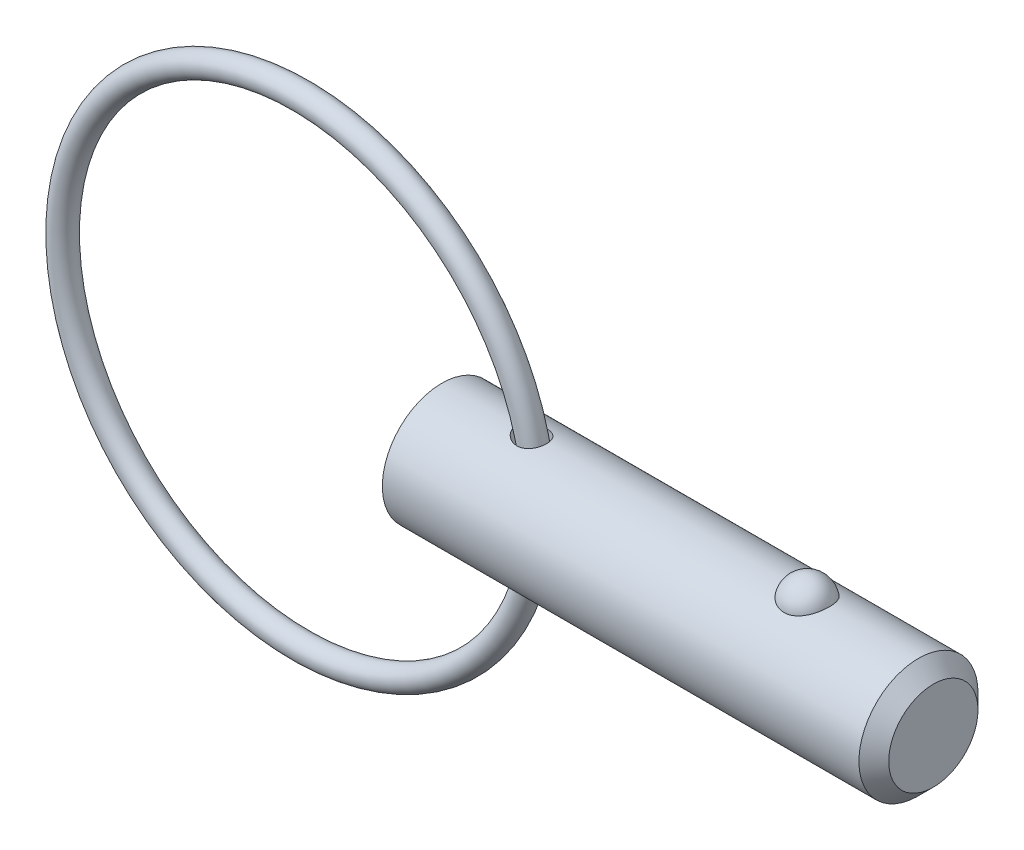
ISO-10303-21;
HEADER;
FILE_DESCRIPTION(('STEP AP214'),'2;1');
FILE_NAME('part.step','',(''),(''),'','','');
FILE_SCHEMA(('AUTOMOTIVE_DESIGN { 1 0 10303 214 1 1 1 1 }'));
ENDSEC;
DATA;
#1=APPLICATION_CONTEXT('core data for automotive mechanical design processes');
#2=APPLICATION_PROTOCOL_DEFINITION('international standard','automotive_design',2000,#1);
#3=PRODUCT_CONTEXT('',#1,'mechanical');
#4=PRODUCT('Part','Part','',(#3));
#5=PRODUCT_RELATED_PRODUCT_CATEGORY('part','',(#4));
#6=PRODUCT_DEFINITION_FORMATION('','',#4);
#7=PRODUCT_DEFINITION_CONTEXT('part definition',#1,'design');
#8=PRODUCT_DEFINITION('design','',#6,#7);
#9=PRODUCT_DEFINITION_SHAPE('','',#8);
#10=(LENGTH_UNIT() NAMED_UNIT(*) SI_UNIT(.MILLI.,.METRE.));
#11=(NAMED_UNIT(*) PLANE_ANGLE_UNIT() SI_UNIT($,.RADIAN.));
#12=(NAMED_UNIT(*) SI_UNIT($,.STERADIAN.) SOLID_ANGLE_UNIT());
#13=UNCERTAINTY_MEASURE_WITH_UNIT(LENGTH_MEASURE(1.E-05),#10,'distance_accuracy_value','');
#14=(GEOMETRIC_REPRESENTATION_CONTEXT(3) GLOBAL_UNCERTAINTY_ASSIGNED_CONTEXT((#13)) GLOBAL_UNIT_ASSIGNED_CONTEXT((#10,
#11,#12)) REPRESENTATION_CONTEXT('',''));
#15=CARTESIAN_POINT('',(0.,0.,0.));
#16=DIRECTION('',(0.,0.,1.));
#17=DIRECTION('',(1.,0.,0.));
#18=AXIS2_PLACEMENT_3D('',#15,#16,#17);
#19=CARTESIAN_POINT('',(-7.52490236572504,0.,0.));
#20=DIRECTION('',(0.,0.,1.));
#21=DIRECTION('',(1.,0.,0.));
#22=AXIS2_PLACEMENT_3D('',#19,#20,#21);
#23=TOROIDAL_SURFACE('',#22,12.7,0.635000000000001);
#24=CARTESIAN_POINT('',(5.81009763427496,0.,0.));
#25=VERTEX_POINT('',#24);
#26=VERTEX_LOOP('',#25);
#27=FACE_BOUND('',#26,.T.);
#28=ADVANCED_FACE('P0_F12',(#27),#23,.T.);
#29=CLOSED_SHELL('',(#28));
#30=MANIFOLD_SOLID_BREP('P0_B1',#29);
#31=CARTESIAN_POINT('',(0.,0.,0.));
#32=DIRECTION('',(1.,0.,0.));
#33=DIRECTION('',(0.,0.,-1.));
#34=AXIS2_PLACEMENT_3D('',#31,#32,#33);
#35=CYLINDRICAL_SURFACE('',#34,3.175);
#36=CARTESIAN_POINT('',(4.01221718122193,3.16142308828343,-0.293307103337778));
#37=CARTESIAN_POINT('',(4.03067993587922,3.15750982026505,-0.335477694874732));
#38=CARTESIAN_POINT('',(4.05297703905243,3.15289835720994,-0.375943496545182));
#39=CARTESIAN_POINT('',(4.10415276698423,3.14284099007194,-0.45240794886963));
#40=CARTESIAN_POINT('',(4.13304477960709,3.13739339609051,-0.488397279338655));
#41=CARTESIAN_POINT('',(4.19615348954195,3.12629932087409,-0.554988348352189));
#42=CARTESIAN_POINT('',(4.23034557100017,3.12065384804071,-0.585613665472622));
#43=CARTESIAN_POINT('',(4.30313282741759,3.10972452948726,-0.641123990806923));
#44=CARTESIAN_POINT('',(4.34172706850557,3.10444060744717,-0.666010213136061));
#45=CARTESIAN_POINT('',(4.42517725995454,3.09444053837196,-0.711079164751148));
#46=CARTESIAN_POINT('',(4.4702815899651,3.08978882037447,-0.730818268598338));
#47=CARTESIAN_POINT('',(4.56327045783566,3.08209858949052,-0.762602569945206));
#48=CARTESIAN_POINT('',(4.61115533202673,3.07906027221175,-0.774646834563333));
#49=CARTESIAN_POINT('',(4.70827322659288,3.0750396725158,-0.790458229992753));
#50=CARTESIAN_POINT('',(4.75750323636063,3.07405312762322,-0.794242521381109));
#51=CARTESIAN_POINT('',(4.85586074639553,3.07433427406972,-0.793155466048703));
#52=CARTESIAN_POINT('',(4.90498828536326,3.07560084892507,-0.788288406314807));
#53=CARTESIAN_POINT('',(4.99830385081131,3.08013122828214,-0.770385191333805));
#54=CARTESIAN_POINT('',(5.04260499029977,3.08325928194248,-0.757902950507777));
#55=CARTESIAN_POINT('',(5.12824625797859,3.09104671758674,-0.72548689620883));
#56=CARTESIAN_POINT('',(5.16958706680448,3.09570574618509,-0.705554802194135));
#57=CARTESIAN_POINT('',(5.24627719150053,3.10576748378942,-0.659813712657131));
#58=CARTESIAN_POINT('',(5.28181038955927,3.11112830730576,-0.634302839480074));
#59=CARTESIAN_POINT('',(5.34802604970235,3.12213947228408,-0.577667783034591));
#60=CARTESIAN_POINT('',(5.37870854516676,3.1277898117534,-0.54654363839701));
#61=CARTESIAN_POINT('',(5.43445707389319,3.13876145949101,-0.479533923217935));
#62=CARTESIAN_POINT('',(5.45951927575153,3.14408254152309,-0.443645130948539));
#63=CARTESIAN_POINT('',(5.50339935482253,3.15381660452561,-0.368122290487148));
#64=CARTESIAN_POINT('',(5.52221691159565,3.15822953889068,-0.328488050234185));
#65=CARTESIAN_POINT('',(5.55335622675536,3.16572312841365,-0.246075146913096));
#66=CARTESIAN_POINT('',(5.56559711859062,3.16878711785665,-0.20326439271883));
#67=CARTESIAN_POINT('',(5.58294807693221,3.17317503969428,-0.11613503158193));
#68=CARTESIAN_POINT('',(5.58805800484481,3.17449893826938,-0.0718163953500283));
#69=CARTESIAN_POINT('',(5.59103306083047,3.17526647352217,0.017234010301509));
#70=CARTESIAN_POINT('',(5.5888730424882,3.17470358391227,0.0619666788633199));
#71=CARTESIAN_POINT('',(5.57730300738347,3.17174350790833,0.150422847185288));
#72=CARTESIAN_POINT('',(5.56789286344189,3.16934628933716,0.194146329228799));
#73=CARTESIAN_POINT('',(5.54204285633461,3.16297605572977,0.279344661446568));
#74=CARTESIAN_POINT('',(5.52560272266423,3.15900298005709,0.320819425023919));
#75=CARTESIAN_POINT('',(5.48608205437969,3.14991364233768,0.400340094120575));
#76=CARTESIAN_POINT('',(5.46300145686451,3.14479736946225,0.438385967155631));
#77=CARTESIAN_POINT('',(5.41080575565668,3.1339965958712,0.509900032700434));
#78=CARTESIAN_POINT('',(5.3817004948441,3.12831302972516,0.543375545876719));
#79=CARTESIAN_POINT('',(5.31818122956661,3.11701107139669,0.604852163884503));
#80=CARTESIAN_POINT('',(5.2837678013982,3.11139267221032,0.632853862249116));
#81=CARTESIAN_POINT('',(5.21096127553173,3.10091904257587,0.682320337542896));
#82=CARTESIAN_POINT('',(5.17261393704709,3.09605639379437,0.703850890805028));
#83=CARTESIAN_POINT('',(5.09274050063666,3.08756769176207,0.740203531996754));
#84=CARTESIAN_POINT('',(5.05121474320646,3.08394150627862,0.755026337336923));
#85=CARTESIAN_POINT('',(4.96650658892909,3.07833156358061,0.777582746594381));
#86=CARTESIAN_POINT('',(4.92333841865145,3.07633606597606,0.785367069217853));
#87=CARTESIAN_POINT('',(4.83627503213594,3.07411756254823,0.794006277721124));
#88=CARTESIAN_POINT('',(4.79237971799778,3.07389479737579,0.794860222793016));
#89=CARTESIAN_POINT('',(4.7037564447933,3.0752087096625,0.789761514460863));
#90=CARTESIAN_POINT('',(4.65904075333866,3.07679607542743,0.783612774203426));
#91=CARTESIAN_POINT('',(4.57116325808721,3.08158486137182,0.764561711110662));
#92=CARTESIAN_POINT('',(4.52800197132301,3.08478681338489,0.751657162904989));
#93=CARTESIAN_POINT('',(4.44149370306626,3.09268658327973,0.718486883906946));
#94=CARTESIAN_POINT('',(4.39831651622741,3.0974680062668,0.697797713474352));
#95=CARTESIAN_POINT('',(4.31591226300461,3.10789270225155,0.649792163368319));
#96=CARTESIAN_POINT('',(4.27668695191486,3.11353635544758,0.622472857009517));
#97=CARTESIAN_POINT('',(4.20182407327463,3.1252888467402,0.560557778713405));
#98=CARTESIAN_POINT('',(4.16638921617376,3.13140725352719,0.525717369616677));
#99=CARTESIAN_POINT('',(4.10227951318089,3.14315144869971,0.450199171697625));
#100=CARTESIAN_POINT('',(4.07360231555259,3.14877740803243,0.409523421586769));
#101=CARTESIAN_POINT('',(4.02575866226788,3.15851130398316,0.32574192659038));
#102=CARTESIAN_POINT('',(4.00615248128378,3.16268619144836,0.282896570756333));
#103=CARTESIAN_POINT('',(3.97532986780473,3.16936826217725,0.194163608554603));
#104=CARTESIAN_POINT('',(3.96410589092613,3.17187694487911,0.148278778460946));
#105=CARTESIAN_POINT('',(3.95155037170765,3.17469339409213,0.0604600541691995));
#106=CARTESIAN_POINT('',(3.9492378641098,3.17521926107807,0.0186712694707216));
#107=CARTESIAN_POINT('',(3.95191506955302,3.1746144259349,-0.0646295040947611));
#108=CARTESIAN_POINT('',(3.9568961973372,3.17348567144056,-0.106141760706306));
#109=CARTESIAN_POINT('',(3.97060099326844,3.17043701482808,-0.172031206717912));
#110=CARTESIAN_POINT('',(3.97717137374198,3.16898333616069,-0.196902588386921));
#111=CARTESIAN_POINT('',(3.99283717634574,3.16556630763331,-0.245794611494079));
#112=CARTESIAN_POINT('',(4.00193224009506,3.16360303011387,-0.269815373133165));
#113=CARTESIAN_POINT('',(4.01221718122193,3.16142308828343,-0.293307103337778));
#114=B_SPLINE_CURVE_WITH_KNOTS('',3,(#36,#37,#38,#39,#40,#41,#42,#43,#44,#45,#46,#47,#48,#49,
#50,#51,#52,#53,#54,#55,#56,#57,#58,#59,#60,#61,#62,#63,#64,#65,#66,#67,#68,#69,#70,#71,#72,#73,
#74,#75,#76,#77,#78,#79,#80,#81,#82,#83,#84,#85,#86,#87,#88,#89,#90,#91,#92,#93,#94,#95,#96,#97,
#98,#99,#100,#101,#102,#103,#104,#105,#106,#107,#108,#109,#110,#111,#112,#113),.UNSPECIFIED.,
.T.,.F.,(4,2,2,2,2,2,2,2,2,2,2,2,2,2,2,2,2,2,2,2,2,2,2,2,2,2,2,2,2,2,2,2,2,2,2,2,2,2,4),(0.,
0.138498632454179,0.277280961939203,0.415437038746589,0.553563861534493,0.701231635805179,
0.848917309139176,0.996295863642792,1.14360140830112,1.28129260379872,1.41895203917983,
1.55053732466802,1.68212170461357,1.81379551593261,1.9454760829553,2.07874074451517,
2.21200799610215,2.34573668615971,2.47946772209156,2.61320390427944,2.74694135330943,
2.8804620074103,3.01396817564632,3.14606745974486,3.27815261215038,3.40927820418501,
3.54042159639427,3.6753294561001,3.81028178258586,3.95399377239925,4.09776931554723,
4.24721954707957,4.39661769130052,4.53771923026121,4.67869361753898,4.80361432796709,
4.92838811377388,5.00555170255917,5.08270434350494),.UNSPECIFIED.);
#115=CARTESIAN_POINT('',(4.01221718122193,3.16142308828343,-0.293307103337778));
#116=VERTEX_POINT('',#115);
#117=EDGE_CURVE('P1_E40',#116,#116,#114,.T.);
#118=ORIENTED_EDGE('',*,*,#117,.T.);
#119=EDGE_LOOP('',(#118));
#120=FACE_BOUND('',#119,.T.);
#121=CARTESIAN_POINT('',(25.41625,0.,0.));
#122=DIRECTION('',(1.,0.,0.));
#123=DIRECTION('',(0.,0.,-1.));
#124=AXIS2_PLACEMENT_3D('',#121,#122,#123);
#125=CIRCLE('',#124,3.175);
#126=CARTESIAN_POINT('',(25.41625,0.,-3.175));
#127=VERTEX_POINT('',#126);
#128=EDGE_CURVE('P1_E25',#127,#127,#125,.T.);
#129=ORIENTED_EDGE('',*,*,#128,.F.);
#130=EDGE_LOOP('',(#129));
#131=FACE_BOUND('',#130,.T.);
#132=CARTESIAN_POINT('',(0.,0.,0.));
#133=DIRECTION('',(1.,0.,0.));
#134=DIRECTION('',(0.,0.,-1.));
#135=AXIS2_PLACEMENT_3D('',#132,#133,#134);
#136=CIRCLE('',#135,3.175);
#137=CARTESIAN_POINT('',(0.,0.,-3.175));
#138=VERTEX_POINT('',#137);
#139=EDGE_CURVE('P1_E9',#138,#138,#136,.T.);
#140=ORIENTED_EDGE('',*,*,#139,.T.);
#141=EDGE_LOOP('',(#140));
#142=FACE_BOUND('',#141,.T.);
#143=CARTESIAN_POINT('',(19.4757276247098,2.92898950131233,1.2254164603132));
#144=CARTESIAN_POINT('',(19.412316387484,2.92899434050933,1.22541146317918));
#145=CARTESIAN_POINT('',(19.3487979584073,2.93112688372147,1.2203464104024));
#146=CARTESIAN_POINT('',(19.2235306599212,2.93942752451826,1.20020949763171));
#147=CARTESIAN_POINT('',(19.1617869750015,2.9456063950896,1.1851109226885));
#148=CARTESIAN_POINT('',(19.0420651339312,2.96127115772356,1.14540352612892));
#149=CARTESIAN_POINT('',(18.9840775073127,2.97074831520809,1.12081980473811));
#150=CARTESIAN_POINT('',(18.8731943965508,2.99197584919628,1.06285154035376));
#151=CARTESIAN_POINT('',(18.8202966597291,3.0037252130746,1.02947091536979));
#152=CARTESIAN_POINT('',(18.7192688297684,3.02865714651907,0.953674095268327));
#153=CARTESIAN_POINT('',(18.671324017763,3.04187163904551,0.911021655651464));
#154=CARTESIAN_POINT('',(18.5830360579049,3.06808741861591,0.818400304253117));
#155=CARTESIAN_POINT('',(18.5426952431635,3.08108863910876,0.768429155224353));
#156=CARTESIAN_POINT('',(18.4688039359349,3.10614903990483,0.660064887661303));
#157=CARTESIAN_POINT('',(18.4356330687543,3.11814104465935,0.601396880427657));
#158=CARTESIAN_POINT('',(18.3791190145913,3.13926931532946,0.479026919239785));
#159=CARTESIAN_POINT('',(18.3557764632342,3.14840539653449,0.415324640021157));
#160=CARTESIAN_POINT('',(18.3191785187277,3.16298160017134,0.283885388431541));
#161=CARTESIAN_POINT('',(18.3060407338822,3.16837855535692,0.216110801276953));
#162=CARTESIAN_POINT('',(18.2905676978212,3.17475386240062,0.0791367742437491));
#163=CARTESIAN_POINT('',(18.288232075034,3.17573236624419,0.00993738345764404));
#164=CARTESIAN_POINT('',(18.294388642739,3.17318075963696,-0.127420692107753));
#165=CARTESIAN_POINT('',(18.3028073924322,3.16968122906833,-0.195583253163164));
#166=CARTESIAN_POINT('',(18.3301752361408,3.1585790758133,-0.329413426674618));
#167=CARTESIAN_POINT('',(18.3491245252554,3.15097637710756,-0.395080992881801));
#168=CARTESIAN_POINT('',(18.3972057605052,3.13242485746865,-0.522180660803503));
#169=CARTESIAN_POINT('',(18.4263524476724,3.12147119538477,-0.583606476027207));
#170=CARTESIAN_POINT('',(18.4942352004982,3.09734973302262,-0.700436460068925));
#171=CARTESIAN_POINT('',(18.532972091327,3.08418174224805,-0.7558401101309));
#172=CARTESIAN_POINT('',(18.6194771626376,3.05694884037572,-0.859404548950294));
#173=CARTESIAN_POINT('',(18.6672961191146,3.04287919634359,-0.907521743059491));
#174=CARTESIAN_POINT('',(18.7707353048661,3.01548927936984,-0.994758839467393));
#175=CARTESIAN_POINT('',(18.8263549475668,3.00216895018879,-1.03387941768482));
#176=CARTESIAN_POINT('',(18.9428093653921,2.97810316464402,-1.10126594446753));
#177=CARTESIAN_POINT('',(19.0035182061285,2.96731170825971,-1.12973256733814));
#178=CARTESIAN_POINT('',(19.1293712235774,2.9492893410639,-1.17598467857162));
#179=CARTESIAN_POINT('',(19.1945137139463,2.94205708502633,-1.19377420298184));
#180=CARTESIAN_POINT('',(19.3238562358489,2.93233065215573,-1.21746387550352));
#181=CARTESIAN_POINT('',(19.3879385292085,2.92961621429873,-1.22391763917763));
#182=CARTESIAN_POINT('',(19.5163375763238,2.92855752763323,-1.22644976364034));
#183=CARTESIAN_POINT('',(19.580654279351,2.93021238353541,-1.22253024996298));
#184=CARTESIAN_POINT('',(19.7055239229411,2.9375685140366,-1.20474140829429));
#185=CARTESIAN_POINT('',(19.766131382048,2.94313790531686,-1.19119621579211));
#186=CARTESIAN_POINT('',(19.8841106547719,2.95756226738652,-1.15491492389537));
#187=CARTESIAN_POINT('',(19.9414822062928,2.96641750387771,-1.13217808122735));
#188=CARTESIAN_POINT('',(20.0527699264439,2.98669918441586,-1.07755083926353));
#189=CARTESIAN_POINT('',(20.1065845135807,2.9981771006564,-1.04547308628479));
#190=CARTESIAN_POINT('',(20.2081473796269,3.02240235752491,-0.973220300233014));
#191=CARTESIAN_POINT('',(20.2558942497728,3.03514999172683,-0.933043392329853));
#192=CARTESIAN_POINT('',(20.3465817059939,3.06131230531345,-0.843372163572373));
#193=CARTESIAN_POINT('',(20.3891588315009,3.07472822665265,-0.79351033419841));
#194=CARTESIAN_POINT('',(20.4656765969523,3.10021106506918,-0.687241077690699));
#195=CARTESIAN_POINT('',(20.4996156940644,3.1122777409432,-0.630832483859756));
#196=CARTESIAN_POINT('',(20.5591209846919,3.134208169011,-0.51105938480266));
#197=CARTESIAN_POINT('',(20.5843892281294,3.14399040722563,-0.447531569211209));
#198=CARTESIAN_POINT('',(20.6245117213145,3.15983820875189,-0.31682749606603));
#199=CARTESIAN_POINT('',(20.6393659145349,3.16590375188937,-0.249651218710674));
#200=CARTESIAN_POINT('',(20.658358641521,3.17370076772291,-0.113549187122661));
#201=CARTESIAN_POINT('',(20.6624966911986,3.17543204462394,-0.0446233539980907));
#202=CARTESIAN_POINT('',(20.6599697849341,3.17438372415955,0.0929938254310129));
#203=CARTESIAN_POINT('',(20.6533050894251,3.17160423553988,0.161685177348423));
#204=CARTESIAN_POINT('',(20.6293754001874,3.1618438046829,0.296502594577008));
#205=CARTESIAN_POINT('',(20.6121674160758,3.15488546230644,0.362640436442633));
#206=CARTESIAN_POINT('',(20.567547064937,3.13748892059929,0.490896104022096));
#207=CARTESIAN_POINT('',(20.5401339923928,3.12705048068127,0.553013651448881));
#208=CARTESIAN_POINT('',(20.4754626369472,3.10369139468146,0.671876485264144));
#209=CARTESIAN_POINT('',(20.4381467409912,3.0907563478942,0.728587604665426));
#210=CARTESIAN_POINT('',(20.3545246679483,3.06381731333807,0.834653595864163));
#211=CARTESIAN_POINT('',(20.3082189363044,3.04981337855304,0.884008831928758));
#212=CARTESIAN_POINT('',(20.2077184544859,3.02230423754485,0.973916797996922));
#213=CARTESIAN_POINT('',(20.153535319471,3.00879833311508,1.01448227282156));
#214=CARTESIAN_POINT('',(20.0385299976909,2.98383625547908,1.0857155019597));
#215=CARTESIAN_POINT('',(19.9777053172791,2.9723808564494,1.11637952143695));
#216=CARTESIAN_POINT('',(19.8533690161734,2.95329063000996,1.16592590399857));
#217=CARTESIAN_POINT('',(19.7900230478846,2.9455373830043,1.18517901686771));
#218=CARTESIAN_POINT('',(19.6607664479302,2.9342556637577,1.21284802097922));
#219=CARTESIAN_POINT('',(19.5948641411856,2.93071450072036,1.2212964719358));
#220=CARTESIAN_POINT('',(19.511116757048,2.9291525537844,1.22502505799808));
#221=CARTESIAN_POINT('',(19.4934263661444,2.92898815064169,1.22541785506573));
#222=CARTESIAN_POINT('',(19.4757276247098,2.92898950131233,1.2254164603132));
#223=B_SPLINE_CURVE_WITH_KNOTS('',3,(#143,#144,#145,#146,#147,#148,#149,#150,#151,#152,#153,
#154,#155,#156,#157,#158,#159,#160,#161,#162,#163,#164,#165,#166,#167,#168,#169,#170,#171,#172,
#173,#174,#175,#176,#177,#178,#179,#180,#181,#182,#183,#184,#185,#186,#187,#188,#189,#190,#191,
#192,#193,#194,#195,#196,#197,#198,#199,#200,#201,#202,#203,#204,#205,#206,#207,#208,#209,#210,
#211,#212,#213,#214,#215,#216,#217,#218,#219,#220,#221,#222),.UNSPECIFIED.,.T.,.F.,(4,2,2,2,2,2,
2,2,2,2,2,2,2,2,2,2,2,2,2,2,2,2,2,2,2,2,2,2,2,2,2,2,2,2,2,2,2,2,2,4),(0.,0.190186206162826,
0.380880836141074,0.571074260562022,0.761183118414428,0.956866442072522,1.1526097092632,
1.35701770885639,1.56143892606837,1.76818248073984,1.97491892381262,2.18025109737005,
2.38558707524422,2.59122111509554,2.79687285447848,3.00371012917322,3.2105318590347,
3.41323429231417,3.61586005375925,3.80828192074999,4.00066436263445,4.18685798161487,
4.37306665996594,4.56330302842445,4.75358348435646,4.95345287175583,5.15335793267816,
5.35957003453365,5.56578325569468,5.7720057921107,5.97822335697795,6.183335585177,
6.38846199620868,6.59480900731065,6.80114579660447,7.00718137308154,7.21329457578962,
7.41228022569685,7.61066481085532,7.66374777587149),.UNSPECIFIED.);
#224=CARTESIAN_POINT('',(19.4757276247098,2.92898950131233,1.2254164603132));
#225=VERTEX_POINT('',#224);
#226=EDGE_CURVE('P1_E34',#225,#225,#223,.T.);
#227=ORIENTED_EDGE('',*,*,#226,.T.);
#228=EDGE_LOOP('',(#227));
#229=FACE_BOUND('',#228,.T.);
#230=CARTESIAN_POINT('',(4.01221718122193,-3.16142308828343,-0.293307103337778));
#231=CARTESIAN_POINT('',(3.99616924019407,-3.16482429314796,-0.256648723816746));
#232=CARTESIAN_POINT('',(3.98300872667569,-3.16769953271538,-0.218679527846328));
#233=CARTESIAN_POINT('',(3.96305928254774,-3.17210414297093,-0.141027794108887));
#234=CARTESIAN_POINT('',(3.95626715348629,-3.17363418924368,-0.101346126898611));
#235=CARTESIAN_POINT('',(3.94940055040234,-3.17518116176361,-0.0213063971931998));
#236=CARTESIAN_POINT('',(3.94933713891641,-3.17519559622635,0.019052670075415));
#237=CARTESIAN_POINT('',(3.95595884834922,-3.173703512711,0.0991848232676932));
#238=CARTESIAN_POINT('',(3.96264478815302,-3.17219681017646,0.138957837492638));
#239=CARTESIAN_POINT('',(3.98225001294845,-3.16786598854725,0.216153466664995));
#240=CARTESIAN_POINT('',(3.99506606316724,-3.16506371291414,0.253603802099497));
#241=CARTESIAN_POINT('',(4.0263107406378,-3.15843101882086,0.325977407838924));
#242=CARTESIAN_POINT('',(4.04474073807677,-3.15460034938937,0.360900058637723));
#243=CARTESIAN_POINT('',(4.08796442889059,-3.14597426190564,0.429836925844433));
#244=CARTESIAN_POINT('',(4.11310717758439,-3.1411307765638,0.463625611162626));
#245=CARTESIAN_POINT('',(4.16818460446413,-3.13112506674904,0.526983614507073));
#246=CARTESIAN_POINT('',(4.19812149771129,-3.1259626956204,0.556550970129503));
#247=CARTESIAN_POINT('',(4.26550089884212,-3.11521604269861,0.614003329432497));
#248=CARTESIAN_POINT('',(4.3034063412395,-3.10964747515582,0.641349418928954));
#249=CARTESIAN_POINT('',(4.38313680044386,-3.09926692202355,0.68977116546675));
#250=CARTESIAN_POINT('',(4.42496355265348,-3.09445527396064,0.710844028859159));
#251=CARTESIAN_POINT('',(4.5141785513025,-3.08586578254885,0.747282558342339));
#252=CARTESIAN_POINT('',(4.5617504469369,-3.08216903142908,0.762221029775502));
#253=CARTESIAN_POINT('',(4.65884938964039,-3.076742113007,0.783842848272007));
#254=CARTESIAN_POINT('',(4.7083760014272,-3.07501151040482,0.790528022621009));
#255=CARTESIAN_POINT('',(4.80630979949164,-3.07383938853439,0.7950736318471));
#256=CARTESIAN_POINT('',(4.85470314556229,-3.07432752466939,0.793205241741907));
#257=CARTESIAN_POINT('',(4.95034305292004,-3.07744489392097,0.781023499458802));
#258=CARTESIAN_POINT('',(4.99759012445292,-3.0800731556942,0.770713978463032));
#259=CARTESIAN_POINT('',(5.08626194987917,-3.08693276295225,0.742738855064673));
#260=CARTESIAN_POINT('',(5.1278649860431,-3.09104603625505,0.725607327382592));
#261=CARTESIAN_POINT('',(5.20739903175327,-3.10040746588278,0.684500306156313));
#262=CARTESIAN_POINT('',(5.24533051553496,-3.10565547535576,0.660525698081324));
#263=CARTESIAN_POINT('',(5.31542898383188,-3.11652031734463,0.607160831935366));
#264=CARTESIAN_POINT('',(5.34772618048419,-3.12212297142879,0.577938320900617));
#265=CARTESIAN_POINT('',(5.40696901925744,-3.13320503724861,0.514477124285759));
#266=CARTESIAN_POINT('',(5.43391452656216,-3.13868444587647,0.480238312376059));
#267=CARTESIAN_POINT('',(5.4820017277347,-3.14897211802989,0.407384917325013));
#268=CARTESIAN_POINT('',(5.50309185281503,-3.15377424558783,0.368735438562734));
#269=CARTESIAN_POINT('',(5.53866240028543,-3.16213411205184,0.288380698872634));
#270=CARTESIAN_POINT('',(5.55314252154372,-3.16569179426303,0.246675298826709));
#271=CARTESIAN_POINT('',(5.57526489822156,-3.17121134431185,0.160950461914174));
#272=CARTESIAN_POINT('',(5.58283917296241,-3.17315732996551,0.116912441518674));
#273=CARTESIAN_POINT('',(5.59072863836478,-3.17518554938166,0.0281485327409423));
#274=CARTESIAN_POINT('',(5.59104374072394,-3.17526776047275,-0.0165773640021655));
#275=CARTESIAN_POINT('',(5.58440302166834,-3.17355847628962,-0.105510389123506));
#276=CARTESIAN_POINT('',(5.57743745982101,-3.17176447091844,-0.149716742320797));
#277=CARTESIAN_POINT('',(5.55638330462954,-3.16649194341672,-0.23629572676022));
#278=CARTESIAN_POINT('',(5.54229454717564,-3.16301338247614,-0.278668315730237));
#279=CARTESIAN_POINT('',(5.50732506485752,-3.15474878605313,-0.360378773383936));
#280=CARTESIAN_POINT('',(5.48644386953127,-3.14996266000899,-0.399716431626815));
#281=CARTESIAN_POINT('',(5.43839310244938,-3.13960947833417,-0.474229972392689));
#282=CARTESIAN_POINT('',(5.41122365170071,-3.1340424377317,-0.509405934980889));
#283=CARTESIAN_POINT('',(5.35140258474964,-3.12277449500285,-0.574449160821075));
#284=CARTESIAN_POINT('',(5.31877354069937,-3.11707422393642,-0.604337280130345));
#285=CARTESIAN_POINT('',(5.24883067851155,-3.10616541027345,-0.658116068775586));
#286=CARTESIAN_POINT('',(5.21151752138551,-3.1009567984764,-0.682007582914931));
#287=CARTESIAN_POINT('',(5.13375489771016,-3.09168295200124,-0.722881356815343));
#288=CARTESIAN_POINT('',(5.09335030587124,-3.0876042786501,-0.739946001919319));
#289=CARTESIAN_POINT('',(5.01017421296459,-3.08094605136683,-0.767199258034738));
#290=CARTESIAN_POINT('',(4.96740279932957,-3.07836644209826,-0.777388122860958));
#291=CARTESIAN_POINT('',(4.88066362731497,-3.07495302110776,-0.790782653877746));
#292=CARTESIAN_POINT('',(4.8366943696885,-3.07412150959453,-0.793979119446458));
#293=CARTESIAN_POINT('',(4.74880185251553,-3.07424620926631,-0.79349509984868));
#294=CARTESIAN_POINT('',(4.70487860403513,-3.07520278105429,-0.789813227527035));
#295=CARTESIAN_POINT('',(4.61626456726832,-3.07882608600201,-0.775571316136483));
#296=CARTESIAN_POINT('',(4.571624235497,-3.08156578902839,-0.764717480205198));
#297=CARTESIAN_POINT('',(4.48464592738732,-3.08847909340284,-0.736297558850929));
#298=CARTESIAN_POINT('',(4.44230893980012,-3.09265330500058,-0.718728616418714));
#299=CARTESIAN_POINT('',(4.35823256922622,-3.10228551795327,-0.675988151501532));
#300=CARTESIAN_POINT('',(4.31671586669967,-3.10780992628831,-0.650392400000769));
#301=CARTESIAN_POINT('',(4.23853942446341,-3.11932897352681,-0.592684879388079));
#302=CARTESIAN_POINT('',(4.20188053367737,-3.12532369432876,-0.560571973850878));
#303=CARTESIAN_POINT('',(4.13583653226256,-3.13687565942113,-0.491740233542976));
#304=CARTESIAN_POINT('',(4.10623659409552,-3.14244088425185,-0.455229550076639));
#305=CARTESIAN_POINT('',(4.05384351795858,-3.1527191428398,-0.377513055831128));
#306=CARTESIAN_POINT('',(4.03104346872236,-3.1574330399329,-0.336312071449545));
#307=CARTESIAN_POINT('',(4.01221718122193,-3.16142308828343,-0.293307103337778));
#308=B_SPLINE_CURVE_WITH_KNOTS('',3,(#230,#231,#232,#233,#234,#235,#236,#237,#238,#239,#240,
#241,#242,#243,#244,#245,#246,#247,#248,#249,#250,#251,#252,#253,#254,#255,#256,#257,#258,#259,
#260,#261,#262,#263,#264,#265,#266,#267,#268,#269,#270,#271,#272,#273,#274,#275,#276,#277,#278,
#279,#280,#281,#282,#283,#284,#285,#286,#287,#288,#289,#290,#291,#292,#293,#294,#295,#296,#297,
#298,#299,#300,#301,#302,#303,#304,#305,#306,#307),.UNSPECIFIED.,.T.,.F.,(4,2,2,2,2,2,2,2,2,2,2,
2,2,2,2,2,2,2,2,2,2,2,2,2,2,2,2,2,2,2,2,2,2,2,2,2,2,2,4),(0.,0.120338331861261,
0.240616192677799,0.361091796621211,0.481582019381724,0.60011096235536,0.718668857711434,
0.845336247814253,0.972062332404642,1.1126676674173,1.25333552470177,1.40259505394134,
1.55182153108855,1.69635040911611,1.84081372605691,1.97568175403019,2.11053233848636,
2.24166080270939,2.37279256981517,2.50504501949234,2.63730349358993,2.77085027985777,
2.90439869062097,3.03812599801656,3.17185638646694,3.30559603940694,3.43933311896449,
3.57253035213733,3.70570880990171,3.83722775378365,3.96874184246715,4.10042887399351,
4.23214246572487,4.36961700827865,4.5071501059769,4.65373408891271,4.80034365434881,
4.94166003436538,5.08283228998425),.UNSPECIFIED.);
#309=CARTESIAN_POINT('',(4.01221718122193,-3.16142308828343,-0.293307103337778));
#310=VERTEX_POINT('',#309);
#311=EDGE_CURVE('P1_E17',#310,#310,#308,.T.);
#312=ORIENTED_EDGE('',*,*,#311,.T.);
#313=EDGE_LOOP('',(#312));
#314=FACE_BOUND('',#313,.T.);
#315=ADVANCED_FACE('P1_F13',(#120,#131,#142,#229,#314),#35,.T.);
#316=CARTESIAN_POINT('',(0.,0.,0.));
#317=DIRECTION('',(-1.,0.,0.));
#318=DIRECTION('',(0.,0.,1.));
#319=AXIS2_PLACEMENT_3D('',#316,#317,#318);
#320=PLANE('',#319);
#321=ORIENTED_EDGE('',*,*,#139,.F.);
#322=EDGE_LOOP('',(#321));
#323=FACE_BOUND('',#322,.T.);
#324=ADVANCED_FACE('P1_F15',(#323),#320,.T.);
#325=CARTESIAN_POINT('',(26.21,0.,0.));
#326=DIRECTION('',(-1.,0.,0.));
#327=DIRECTION('',(0.,0.,1.));
#328=AXIS2_PLACEMENT_3D('',#325,#326,#327);
#329=CONICAL_SURFACE('',#328,2.38125,0.785398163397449);
#330=ORIENTED_EDGE('',*,*,#128,.T.);
#331=EDGE_LOOP('',(#330));
#332=FACE_BOUND('',#331,.T.);
#333=CARTESIAN_POINT('',(26.21,0.,0.));
#334=DIRECTION('',(1.,0.,0.));
#335=DIRECTION('',(0.,0.,-1.));
#336=AXIS2_PLACEMENT_3D('',#333,#334,#335);
#337=CIRCLE('',#336,2.38125);
#338=CARTESIAN_POINT('',(26.21,0.,-2.38125));
#339=VERTEX_POINT('',#338);
#340=EDGE_CURVE('P1_E30',#339,#339,#337,.T.);
#341=ORIENTED_EDGE('',*,*,#340,.F.);
#342=EDGE_LOOP('',(#341));
#343=FACE_BOUND('',#342,.T.);
#344=ADVANCED_FACE('P1_F55',(#332,#343),#329,.T.);
#345=CARTESIAN_POINT('',(26.21,2.38125,0.));
#346=DIRECTION('',(1.,0.,0.));
#347=DIRECTION('',(0.,0.,-1.));
#348=AXIS2_PLACEMENT_3D('',#345,#346,#347);
#349=PLANE('',#348);
#350=ORIENTED_EDGE('',*,*,#340,.T.);
#351=EDGE_LOOP('',(#350));
#352=FACE_BOUND('',#351,.T.);
#353=ADVANCED_FACE('P1_F51',(#352),#349,.T.);
#354=CARTESIAN_POINT('',(19.4757276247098,2.8575,0.));
#355=DIRECTION('',(-1.,0.,0.));
#356=DIRECTION('',(0.,1.,0.));
#357=AXIS2_PLACEMENT_3D('',#354,#355,#356);
#358=SPHERICAL_SURFACE('',#357,1.22750000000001);
#359=ORIENTED_EDGE('',*,*,#226,.F.);
#360=EDGE_LOOP('',(#359));
#361=FACE_BOUND('',#360,.T.);
#362=ADVANCED_FACE('P1_F46',(#361),#358,.T.);
#363=CARTESIAN_POINT('',(-7.52490236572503,0.,0.));
#364=DIRECTION('',(0.,0.,1.));
#365=DIRECTION('',(1.,0.,0.));
#366=AXIS2_PLACEMENT_3D('',#363,#364,#365);
#367=TOROIDAL_SURFACE('',#366,12.7,0.79375);
#368=ORIENTED_EDGE('',*,*,#311,.F.);
#369=EDGE_LOOP('',(#368));
#370=FACE_BOUND('',#369,.T.);
#371=ORIENTED_EDGE('',*,*,#117,.F.);
#372=EDGE_LOOP('',(#371));
#373=FACE_BOUND('',#372,.T.);
#374=ADVANCED_FACE('P1_F50',(#370,#373),#367,.F.);
#375=CLOSED_SHELL('',(#315,#324,#344,#353,#362,#374));
#376=MANIFOLD_SOLID_BREP('P1_B1',#375);
#377=ADVANCED_BREP_SHAPE_REPRESENTATION('',(#18,#30,#376),#14);
#378=SHAPE_DEFINITION_REPRESENTATION(#9,#377);
ENDSEC;
END-ISO-10303-21;
